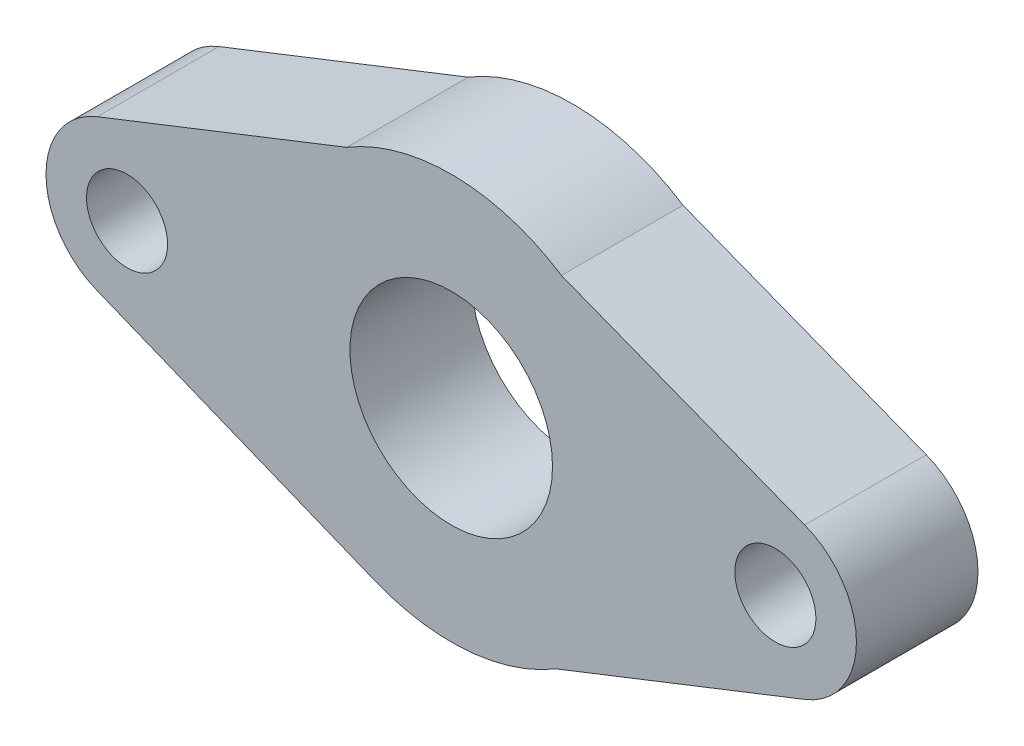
ISO-10303-21;
HEADER;
FILE_DESCRIPTION(('STEP AP214'),'2;1');
FILE_NAME('part.step','',(''),(''),'','','');
FILE_SCHEMA(('AUTOMOTIVE_DESIGN { 1 0 10303 214 1 1 1 1 }'));
ENDSEC;
DATA;
#1=APPLICATION_CONTEXT('core data for automotive mechanical design processes');
#2=APPLICATION_PROTOCOL_DEFINITION('international standard','automotive_design',2000,#1);
#3=PRODUCT_CONTEXT('',#1,'mechanical');
#4=PRODUCT('Part','Part','',(#3));
#5=PRODUCT_RELATED_PRODUCT_CATEGORY('part','',(#4));
#6=PRODUCT_DEFINITION_FORMATION('','',#4);
#7=PRODUCT_DEFINITION_CONTEXT('part definition',#1,'design');
#8=PRODUCT_DEFINITION('design','',#6,#7);
#9=PRODUCT_DEFINITION_SHAPE('','',#8);
#10=(LENGTH_UNIT() NAMED_UNIT(*) SI_UNIT(.MILLI.,.METRE.));
#11=(NAMED_UNIT(*) PLANE_ANGLE_UNIT() SI_UNIT($,.RADIAN.));
#12=(NAMED_UNIT(*) SI_UNIT($,.STERADIAN.) SOLID_ANGLE_UNIT());
#13=UNCERTAINTY_MEASURE_WITH_UNIT(LENGTH_MEASURE(1.E-05),#10,'distance_accuracy_value','');
#14=(GEOMETRIC_REPRESENTATION_CONTEXT(3) GLOBAL_UNCERTAINTY_ASSIGNED_CONTEXT((#13)) GLOBAL_UNIT_ASSIGNED_CONTEXT((#10,
#11,#12)) REPRESENTATION_CONTEXT('',''));
#15=CARTESIAN_POINT('',(0.,0.,0.));
#16=DIRECTION('',(0.,0.,1.));
#17=DIRECTION('',(1.,0.,0.));
#18=AXIS2_PLACEMENT_3D('',#15,#16,#17);
#19=CARTESIAN_POINT('',(0.,0.,15.));
#20=DIRECTION('',(0.,0.,1.));
#21=DIRECTION('',(1.,0.,0.));
#22=AXIS2_PLACEMENT_3D('',#19,#20,#21);
#23=PLANE('',#22);
#24=CARTESIAN_POINT('',(0.,0.,15.));
#25=DIRECTION('',(0.,0.,1.));
#26=DIRECTION('',(1.,0.,0.));
#27=AXIS2_PLACEMENT_3D('',#24,#25,#26);
#28=CIRCLE('',#27,12.5);
#29=CARTESIAN_POINT('',(12.5,0.,15.));
#30=VERTEX_POINT('',#29);
#31=EDGE_CURVE('E219',#30,#30,#28,.T.);
#32=ORIENTED_EDGE('',*,*,#31,.F.);
#33=EDGE_LOOP('',(#32));
#34=FACE_BOUND('',#33,.T.);
#35=CARTESIAN_POINT('',(0.,0.,15.));
#36=DIRECTION('',(0.,0.,1.));
#37=DIRECTION('',(1.,0.,0.));
#38=AXIS2_PLACEMENT_3D('',#35,#36,#37);
#39=CIRCLE('',#38,25.);
#40=CARTESIAN_POINT('',(13.6042945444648,20.9743455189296,15.));
#41=VERTEX_POINT('',#40);
#42=CARTESIAN_POINT('',(-12.9104271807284,21.4084298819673,15.));
#43=VERTEX_POINT('',#42);
#44=EDGE_CURVE('E170',#41,#43,#39,.T.);
#45=ORIENTED_EDGE('',*,*,#44,.T.);
#46=DIRECTION('',(-0.930523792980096,-0.36623144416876,0.));
#47=VECTOR('',#46,1.);
#48=CARTESIAN_POINT('',(-43.6623144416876,9.30523792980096,15.));
#49=LINE('',#48,#47);
#50=CARTESIAN_POINT('',(-43.6623144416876,9.30523792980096,15.));
#51=VERTEX_POINT('',#50);
#52=EDGE_CURVE('E106',#43,#51,#49,.T.);
#53=ORIENTED_EDGE('',*,*,#52,.T.);
#54=CARTESIAN_POINT('',(-40.,0.,15.));
#55=DIRECTION('',(0.,0.,1.));
#56=DIRECTION('',(1.,0.,0.));
#57=AXIS2_PLACEMENT_3D('',#54,#55,#56);
#58=CIRCLE('',#57,10.);
#59=CARTESIAN_POINT('',(-43.7498569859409,-9.27030595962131,15.));
#60=VERTEX_POINT('',#59);
#61=EDGE_CURVE('E191',#51,#60,#58,.T.);
#62=ORIENTED_EDGE('',*,*,#61,.T.);
#63=DIRECTION('',(0.92703059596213,-0.374985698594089,0.));
#64=VECTOR('',#63,1.);
#65=CARTESIAN_POINT('',(-43.7498569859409,-9.27030595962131,15.));
#66=LINE('',#65,#64);
#67=CARTESIAN_POINT('',(-9.5312098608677,-23.1118159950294,15.));
#68=VERTEX_POINT('',#67);
#69=EDGE_CURVE('E205',#60,#68,#66,.T.);
#70=ORIENTED_EDGE('',*,*,#69,.T.);
#71=CARTESIAN_POINT('',(0.,0.,15.));
#72=DIRECTION('',(0.,0.,1.));
#73=DIRECTION('',(1.,0.,0.));
#74=AXIS2_PLACEMENT_3D('',#71,#72,#73);
#75=CIRCLE('',#74,25.);
#76=CARTESIAN_POINT('',(12.9104271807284,-21.4084298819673,15.));
#77=VERTEX_POINT('',#76);
#78=EDGE_CURVE('E125',#68,#77,#75,.T.);
#79=ORIENTED_EDGE('',*,*,#78,.T.);
#80=DIRECTION('',(0.930523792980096,0.36623144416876,0.));
#81=VECTOR('',#80,1.);
#82=CARTESIAN_POINT('',(12.9104271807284,-21.4084298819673,15.));
#83=LINE('',#82,#81);
#84=CARTESIAN_POINT('',(43.6623144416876,-9.30523792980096,15.));
#85=VERTEX_POINT('',#84);
#86=EDGE_CURVE('E119',#77,#85,#83,.T.);
#87=ORIENTED_EDGE('',*,*,#86,.T.);
#88=CARTESIAN_POINT('',(40.,0.,15.));
#89=DIRECTION('',(0.,0.,1.));
#90=DIRECTION('',(1.,0.,0.));
#91=AXIS2_PLACEMENT_3D('',#88,#89,#90);
#92=CIRCLE('',#91,10.);
#93=CARTESIAN_POINT('',(43.6190098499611,9.3221653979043,15.));
#94=VERTEX_POINT('',#93);
#95=EDGE_CURVE('E123',#85,#94,#92,.T.);
#96=ORIENTED_EDGE('',*,*,#95,.T.);
#97=DIRECTION('',(-0.93221653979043,0.361900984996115,0.));
#98=VECTOR('',#97,1.);
#99=CARTESIAN_POINT('',(43.6190098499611,9.3221653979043,15.));
#100=LINE('',#99,#98);
#101=EDGE_CURVE('E63',#94,#41,#100,.T.);
#102=ORIENTED_EDGE('',*,*,#101,.T.);
#103=EDGE_LOOP('',(#45,#53,#62,#70,#79,#87,#96,#102));
#104=FACE_BOUND('',#103,.T.);
#105=CARTESIAN_POINT('',(-40.,0.,15.));
#106=DIRECTION('',(0.,0.,1.));
#107=DIRECTION('',(1.,0.,0.));
#108=AXIS2_PLACEMENT_3D('',#105,#106,#107);
#109=CIRCLE('',#108,5.);
#110=CARTESIAN_POINT('',(-35.,0.,15.));
#111=VERTEX_POINT('',#110);
#112=EDGE_CURVE('E152',#111,#111,#109,.T.);
#113=ORIENTED_EDGE('',*,*,#112,.F.);
#114=EDGE_LOOP('',(#113));
#115=FACE_BOUND('',#114,.T.);
#116=CARTESIAN_POINT('',(40.,0.,15.));
#117=DIRECTION('',(0.,0.,1.));
#118=DIRECTION('',(1.,0.,0.));
#119=AXIS2_PLACEMENT_3D('',#116,#117,#118);
#120=CIRCLE('',#119,5.);
#121=CARTESIAN_POINT('',(45.,0.,15.));
#122=VERTEX_POINT('',#121);
#123=EDGE_CURVE('E227',#122,#122,#120,.T.);
#124=ORIENTED_EDGE('',*,*,#123,.F.);
#125=EDGE_LOOP('',(#124));
#126=FACE_BOUND('',#125,.T.);
#127=ADVANCED_FACE('F45',(#34,#104,#115,#126),#23,.T.);
#128=CARTESIAN_POINT('',(0.,0.,0.));
#129=DIRECTION('',(0.,0.,1.));
#130=DIRECTION('',(1.,0.,0.));
#131=AXIS2_PLACEMENT_3D('',#128,#129,#130);
#132=PLANE('',#131);
#133=CARTESIAN_POINT('',(0.,0.,0.));
#134=DIRECTION('',(0.,0.,1.));
#135=DIRECTION('',(1.,0.,0.));
#136=AXIS2_PLACEMENT_3D('',#133,#134,#135);
#137=CIRCLE('',#136,25.);
#138=CARTESIAN_POINT('',(13.6042945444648,20.9743455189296,0.));
#139=VERTEX_POINT('',#138);
#140=CARTESIAN_POINT('',(-12.9104271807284,21.4084298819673,0.));
#141=VERTEX_POINT('',#140);
#142=EDGE_CURVE('E147',#139,#141,#137,.T.);
#143=ORIENTED_EDGE('',*,*,#142,.F.);
#144=DIRECTION('',(-0.93221653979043,0.361900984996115,0.));
#145=VECTOR('',#144,1.);
#146=CARTESIAN_POINT('',(43.6190098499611,9.3221653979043,0.));
#147=LINE('',#146,#145);
#148=CARTESIAN_POINT('',(43.6190098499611,9.3221653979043,0.));
#149=VERTEX_POINT('',#148);
#150=EDGE_CURVE('E98',#149,#139,#147,.T.);
#151=ORIENTED_EDGE('',*,*,#150,.F.);
#152=CARTESIAN_POINT('',(40.,0.,0.));
#153=DIRECTION('',(0.,0.,1.));
#154=DIRECTION('',(1.,0.,0.));
#155=AXIS2_PLACEMENT_3D('',#152,#153,#154);
#156=CIRCLE('',#155,10.);
#157=CARTESIAN_POINT('',(43.6623144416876,-9.30523792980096,0.));
#158=VERTEX_POINT('',#157);
#159=EDGE_CURVE('E92',#158,#149,#156,.T.);
#160=ORIENTED_EDGE('',*,*,#159,.F.);
#161=DIRECTION('',(0.930523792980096,0.36623144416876,0.));
#162=VECTOR('',#161,1.);
#163=CARTESIAN_POINT('',(12.9104271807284,-21.4084298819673,0.));
#164=LINE('',#163,#162);
#165=CARTESIAN_POINT('',(12.9104271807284,-21.4084298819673,0.));
#166=VERTEX_POINT('',#165);
#167=EDGE_CURVE('E134',#166,#158,#164,.T.);
#168=ORIENTED_EDGE('',*,*,#167,.F.);
#169=CARTESIAN_POINT('',(0.,0.,0.));
#170=DIRECTION('',(0.,0.,1.));
#171=DIRECTION('',(1.,0.,0.));
#172=AXIS2_PLACEMENT_3D('',#169,#170,#171);
#173=CIRCLE('',#172,25.);
#174=CARTESIAN_POINT('',(-9.5312098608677,-23.1118159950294,0.));
#175=VERTEX_POINT('',#174);
#176=EDGE_CURVE('E161',#175,#166,#173,.T.);
#177=ORIENTED_EDGE('',*,*,#176,.F.);
#178=DIRECTION('',(0.92703059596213,-0.374985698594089,0.));
#179=VECTOR('',#178,1.);
#180=CARTESIAN_POINT('',(-43.7498569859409,-9.27030595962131,0.));
#181=LINE('',#180,#179);
#182=CARTESIAN_POINT('',(-43.7498569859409,-9.27030595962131,0.));
#183=VERTEX_POINT('',#182);
#184=EDGE_CURVE('E158',#183,#175,#181,.T.);
#185=ORIENTED_EDGE('',*,*,#184,.F.);
#186=CARTESIAN_POINT('',(-40.,0.,0.));
#187=DIRECTION('',(0.,0.,1.));
#188=DIRECTION('',(1.,0.,0.));
#189=AXIS2_PLACEMENT_3D('',#186,#187,#188);
#190=CIRCLE('',#189,10.);
#191=CARTESIAN_POINT('',(-43.6623144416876,9.30523792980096,0.));
#192=VERTEX_POINT('',#191);
#193=EDGE_CURVE('E155',#192,#183,#190,.T.);
#194=ORIENTED_EDGE('',*,*,#193,.F.);
#195=DIRECTION('',(-0.930523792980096,-0.36623144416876,0.));
#196=VECTOR('',#195,1.);
#197=CARTESIAN_POINT('',(-43.6623144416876,9.30523792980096,0.));
#198=LINE('',#197,#196);
#199=EDGE_CURVE('E151',#141,#192,#198,.T.);
#200=ORIENTED_EDGE('',*,*,#199,.F.);
#201=EDGE_LOOP('',(#143,#151,#160,#168,#177,#185,#194,#200));
#202=FACE_BOUND('',#201,.T.);
#203=CARTESIAN_POINT('',(-40.,0.,0.));
#204=DIRECTION('',(0.,0.,1.));
#205=DIRECTION('',(1.,0.,0.));
#206=AXIS2_PLACEMENT_3D('',#203,#204,#205);
#207=CIRCLE('',#206,5.);
#208=CARTESIAN_POINT('',(-35.,0.,0.));
#209=VERTEX_POINT('',#208);
#210=EDGE_CURVE('E215',#209,#209,#207,.T.);
#211=ORIENTED_EDGE('',*,*,#210,.T.);
#212=EDGE_LOOP('',(#211));
#213=FACE_BOUND('',#212,.T.);
#214=CARTESIAN_POINT('',(0.,0.,0.));
#215=DIRECTION('',(0.,0.,1.));
#216=DIRECTION('',(1.,0.,0.));
#217=AXIS2_PLACEMENT_3D('',#214,#215,#216);
#218=CIRCLE('',#217,12.5);
#219=CARTESIAN_POINT('',(12.5,0.,0.));
#220=VERTEX_POINT('',#219);
#221=EDGE_CURVE('E223',#220,#220,#218,.T.);
#222=ORIENTED_EDGE('',*,*,#221,.T.);
#223=EDGE_LOOP('',(#222));
#224=FACE_BOUND('',#223,.T.);
#225=CARTESIAN_POINT('',(40.,0.,0.));
#226=DIRECTION('',(0.,0.,1.));
#227=DIRECTION('',(1.,0.,0.));
#228=AXIS2_PLACEMENT_3D('',#225,#226,#227);
#229=CIRCLE('',#228,5.);
#230=CARTESIAN_POINT('',(45.,0.,0.));
#231=VERTEX_POINT('',#230);
#232=EDGE_CURVE('E231',#231,#231,#229,.T.);
#233=ORIENTED_EDGE('',*,*,#232,.T.);
#234=EDGE_LOOP('',(#233));
#235=FACE_BOUND('',#234,.T.);
#236=ADVANCED_FACE('F195',(#202,#213,#224,#235),#132,.F.);
#237=CARTESIAN_POINT('',(0.,0.,15.));
#238=DIRECTION('',(0.,0.,-1.));
#239=DIRECTION('',(-1.,0.,0.));
#240=AXIS2_PLACEMENT_3D('',#237,#238,#239);
#241=CYLINDRICAL_SURFACE('',#240,25.);
#242=ORIENTED_EDGE('',*,*,#142,.T.);
#243=DIRECTION('',(0.,0.,-1.));
#244=VECTOR('',#243,1.);
#245=CARTESIAN_POINT('',(-12.9104271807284,21.4084298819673,15.));
#246=LINE('',#245,#244);
#247=EDGE_CURVE('E11',#43,#141,#246,.T.);
#248=ORIENTED_EDGE('',*,*,#247,.F.);
#249=ORIENTED_EDGE('',*,*,#44,.F.);
#250=DIRECTION('',(0.,0.,-1.));
#251=VECTOR('',#250,1.);
#252=CARTESIAN_POINT('',(13.6042945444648,20.9743455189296,15.));
#253=LINE('',#252,#251);
#254=EDGE_CURVE('E143',#41,#139,#253,.T.);
#255=ORIENTED_EDGE('',*,*,#254,.T.);
#256=EDGE_LOOP('',(#242,#248,#249,#255));
#257=FACE_BOUND('',#256,.T.);
#258=ADVANCED_FACE('F47',(#257),#241,.T.);
#259=CARTESIAN_POINT('',(-43.6623144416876,9.30523792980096,15.));
#260=DIRECTION('',(0.36623144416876,-0.930523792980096,0.));
#261=DIRECTION('',(0.930523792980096,0.36623144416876,0.));
#262=AXIS2_PLACEMENT_3D('',#259,#260,#261);
#263=PLANE('',#262);
#264=ORIENTED_EDGE('',*,*,#199,.T.);
#265=DIRECTION('',(0.,0.,-1.));
#266=VECTOR('',#265,1.);
#267=CARTESIAN_POINT('',(-43.6623144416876,9.30523792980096,15.));
#268=LINE('',#267,#266);
#269=EDGE_CURVE('E55',#51,#192,#268,.T.);
#270=ORIENTED_EDGE('',*,*,#269,.F.);
#271=ORIENTED_EDGE('',*,*,#52,.F.);
#272=ORIENTED_EDGE('',*,*,#247,.T.);
#273=EDGE_LOOP('',(#264,#270,#271,#272));
#274=FACE_BOUND('',#273,.T.);
#275=ADVANCED_FACE('F266',(#274),#263,.F.);
#276=CARTESIAN_POINT('',(-40.,0.,15.));
#277=DIRECTION('',(0.,0.,-1.));
#278=DIRECTION('',(-1.,0.,0.));
#279=AXIS2_PLACEMENT_3D('',#276,#277,#278);
#280=CYLINDRICAL_SURFACE('',#279,10.);
#281=ORIENTED_EDGE('',*,*,#193,.T.);
#282=DIRECTION('',(0.,0.,-1.));
#283=VECTOR('',#282,1.);
#284=CARTESIAN_POINT('',(-43.7498569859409,-9.27030595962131,15.));
#285=LINE('',#284,#283);
#286=EDGE_CURVE('E181',#60,#183,#285,.T.);
#287=ORIENTED_EDGE('',*,*,#286,.F.);
#288=ORIENTED_EDGE('',*,*,#61,.F.);
#289=ORIENTED_EDGE('',*,*,#269,.T.);
#290=EDGE_LOOP('',(#281,#287,#288,#289));
#291=FACE_BOUND('',#290,.T.);
#292=ADVANCED_FACE('F189',(#291),#280,.T.);
#293=CARTESIAN_POINT('',(-43.7498569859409,-9.27030595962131,15.));
#294=DIRECTION('',(0.37498569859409,0.92703059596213,0.));
#295=DIRECTION('',(-0.92703059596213,0.37498569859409,0.));
#296=AXIS2_PLACEMENT_3D('',#293,#294,#295);
#297=PLANE('',#296);
#298=ORIENTED_EDGE('',*,*,#184,.T.);
#299=DIRECTION('',(0.,0.,-1.));
#300=VECTOR('',#299,1.);
#301=CARTESIAN_POINT('',(-9.5312098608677,-23.1118159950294,15.));
#302=LINE('',#301,#300);
#303=EDGE_CURVE('E177',#68,#175,#302,.T.);
#304=ORIENTED_EDGE('',*,*,#303,.F.);
#305=ORIENTED_EDGE('',*,*,#69,.F.);
#306=ORIENTED_EDGE('',*,*,#286,.T.);
#307=EDGE_LOOP('',(#298,#304,#305,#306));
#308=FACE_BOUND('',#307,.T.);
#309=ADVANCED_FACE('F200',(#308),#297,.F.);
#310=CARTESIAN_POINT('',(0.,0.,15.));
#311=DIRECTION('',(0.,0.,-1.));
#312=DIRECTION('',(-1.,0.,0.));
#313=AXIS2_PLACEMENT_3D('',#310,#311,#312);
#314=CYLINDRICAL_SURFACE('',#313,25.);
#315=ORIENTED_EDGE('',*,*,#176,.T.);
#316=DIRECTION('',(0.,0.,-1.));
#317=VECTOR('',#316,1.);
#318=CARTESIAN_POINT('',(12.9104271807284,-21.4084298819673,15.));
#319=LINE('',#318,#317);
#320=EDGE_CURVE('E136',#77,#166,#319,.T.);
#321=ORIENTED_EDGE('',*,*,#320,.F.);
#322=ORIENTED_EDGE('',*,*,#78,.F.);
#323=ORIENTED_EDGE('',*,*,#303,.T.);
#324=EDGE_LOOP('',(#315,#321,#322,#323));
#325=FACE_BOUND('',#324,.T.);
#326=ADVANCED_FACE('F203',(#325),#314,.T.);
#327=CARTESIAN_POINT('',(12.9104271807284,-21.4084298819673,15.));
#328=DIRECTION('',(-0.36623144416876,0.930523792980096,0.));
#329=DIRECTION('',(-0.930523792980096,-0.36623144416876,0.));
#330=AXIS2_PLACEMENT_3D('',#327,#328,#329);
#331=PLANE('',#330);
#332=ORIENTED_EDGE('',*,*,#167,.T.);
#333=DIRECTION('',(0.,0.,-1.));
#334=VECTOR('',#333,1.);
#335=CARTESIAN_POINT('',(43.6623144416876,-9.30523792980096,15.));
#336=LINE('',#335,#334);
#337=EDGE_CURVE('E131',#85,#158,#336,.T.);
#338=ORIENTED_EDGE('',*,*,#337,.F.);
#339=ORIENTED_EDGE('',*,*,#86,.F.);
#340=ORIENTED_EDGE('',*,*,#320,.T.);
#341=EDGE_LOOP('',(#332,#338,#339,#340));
#342=FACE_BOUND('',#341,.T.);
#343=ADVANCED_FACE('F132',(#342),#331,.F.);
#344=CARTESIAN_POINT('',(40.,0.,15.));
#345=DIRECTION('',(0.,0.,-1.));
#346=DIRECTION('',(-1.,0.,0.));
#347=AXIS2_PLACEMENT_3D('',#344,#345,#346);
#348=CYLINDRICAL_SURFACE('',#347,10.);
#349=ORIENTED_EDGE('',*,*,#159,.T.);
#350=DIRECTION('',(0.,0.,-1.));
#351=VECTOR('',#350,1.);
#352=CARTESIAN_POINT('',(43.6190098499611,9.3221653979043,15.));
#353=LINE('',#352,#351);
#354=EDGE_CURVE('E137',#94,#149,#353,.T.);
#355=ORIENTED_EDGE('',*,*,#354,.F.);
#356=ORIENTED_EDGE('',*,*,#95,.F.);
#357=ORIENTED_EDGE('',*,*,#337,.T.);
#358=EDGE_LOOP('',(#349,#355,#356,#357));
#359=FACE_BOUND('',#358,.T.);
#360=ADVANCED_FACE('F139',(#359),#348,.T.);
#361=CARTESIAN_POINT('',(43.6190098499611,9.3221653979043,15.));
#362=DIRECTION('',(-0.361900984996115,-0.93221653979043,0.));
#363=DIRECTION('',(0.93221653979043,-0.361900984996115,0.));
#364=AXIS2_PLACEMENT_3D('',#361,#362,#363);
#365=PLANE('',#364);
#366=ORIENTED_EDGE('',*,*,#150,.T.);
#367=ORIENTED_EDGE('',*,*,#254,.F.);
#368=ORIENTED_EDGE('',*,*,#101,.F.);
#369=ORIENTED_EDGE('',*,*,#354,.T.);
#370=EDGE_LOOP('',(#366,#367,#368,#369));
#371=FACE_BOUND('',#370,.T.);
#372=ADVANCED_FACE('F254',(#371),#365,.F.);
#373=CARTESIAN_POINT('',(-40.,0.,15.));
#374=DIRECTION('',(0.,0.,-1.));
#375=DIRECTION('',(-1.,0.,0.));
#376=AXIS2_PLACEMENT_3D('',#373,#374,#375);
#377=CYLINDRICAL_SURFACE('',#376,5.);
#378=ORIENTED_EDGE('',*,*,#112,.T.);
#379=EDGE_LOOP('',(#378));
#380=FACE_BOUND('',#379,.T.);
#381=ORIENTED_EDGE('',*,*,#210,.F.);
#382=EDGE_LOOP('',(#381));
#383=FACE_BOUND('',#382,.T.);
#384=ADVANCED_FACE('F251',(#380,#383),#377,.F.);
#385=CARTESIAN_POINT('',(0.,0.,15.));
#386=DIRECTION('',(0.,0.,-1.));
#387=DIRECTION('',(-1.,0.,0.));
#388=AXIS2_PLACEMENT_3D('',#385,#386,#387);
#389=CYLINDRICAL_SURFACE('',#388,12.5);
#390=ORIENTED_EDGE('',*,*,#31,.T.);
#391=EDGE_LOOP('',(#390));
#392=FACE_BOUND('',#391,.T.);
#393=ORIENTED_EDGE('',*,*,#221,.F.);
#394=EDGE_LOOP('',(#393));
#395=FACE_BOUND('',#394,.T.);
#396=ADVANCED_FACE('F364',(#392,#395),#389,.F.);
#397=CARTESIAN_POINT('',(40.,0.,15.));
#398=DIRECTION('',(0.,0.,-1.));
#399=DIRECTION('',(-1.,0.,0.));
#400=AXIS2_PLACEMENT_3D('',#397,#398,#399);
#401=CYLINDRICAL_SURFACE('',#400,5.);
#402=ORIENTED_EDGE('',*,*,#123,.T.);
#403=EDGE_LOOP('',(#402));
#404=FACE_BOUND('',#403,.T.);
#405=ORIENTED_EDGE('',*,*,#232,.F.);
#406=EDGE_LOOP('',(#405));
#407=FACE_BOUND('',#406,.T.);
#408=ADVANCED_FACE('F239',(#404,#407),#401,.F.);
#409=CLOSED_SHELL('',(#127,#236,#258,#275,#292,#309,#326,#343,#360,#372,#384,#396,#408));
#410=MANIFOLD_SOLID_BREP('B2',#409);
#411=ADVANCED_BREP_SHAPE_REPRESENTATION('',(#18,#410),#14);
#412=SHAPE_DEFINITION_REPRESENTATION(#9,#411);
ENDSEC;
END-ISO-10303-21;
